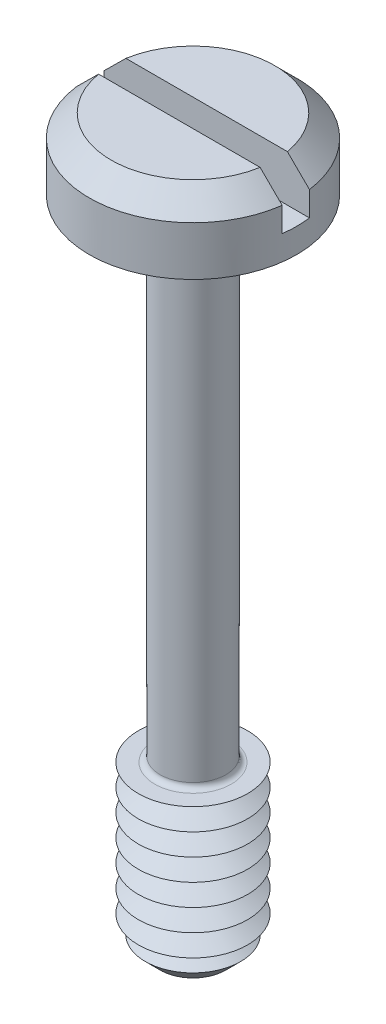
ISO-10303-21;
HEADER;
FILE_DESCRIPTION(('STEP AP214'),'2;1');
FILE_NAME('part.step','',(''),(''),'','','');
FILE_SCHEMA(('AUTOMOTIVE_DESIGN { 1 0 10303 214 1 1 1 1 }'));
ENDSEC;
DATA;
#1=APPLICATION_CONTEXT('core data for automotive mechanical design processes');
#2=APPLICATION_PROTOCOL_DEFINITION('international standard','automotive_design',2000,#1);
#3=PRODUCT_CONTEXT('',#1,'mechanical');
#4=PRODUCT('Part','Part','',(#3));
#5=PRODUCT_RELATED_PRODUCT_CATEGORY('part','',(#4));
#6=PRODUCT_DEFINITION_FORMATION('','',#4);
#7=PRODUCT_DEFINITION_CONTEXT('part definition',#1,'design');
#8=PRODUCT_DEFINITION('design','',#6,#7);
#9=PRODUCT_DEFINITION_SHAPE('','',#8);
#10=(LENGTH_UNIT() NAMED_UNIT(*) SI_UNIT(.MILLI.,.METRE.));
#11=(NAMED_UNIT(*) PLANE_ANGLE_UNIT() SI_UNIT($,.RADIAN.));
#12=(NAMED_UNIT(*) SI_UNIT($,.STERADIAN.) SOLID_ANGLE_UNIT());
#13=UNCERTAINTY_MEASURE_WITH_UNIT(LENGTH_MEASURE(1.E-05),#10,'distance_accuracy_value','');
#14=(GEOMETRIC_REPRESENTATION_CONTEXT(3) GLOBAL_UNCERTAINTY_ASSIGNED_CONTEXT((#13)) GLOBAL_UNIT_ASSIGNED_CONTEXT((#10,
#11,#12)) REPRESENTATION_CONTEXT('',''));
#15=CARTESIAN_POINT('',(0.,0.,0.));
#16=DIRECTION('',(0.,0.,1.));
#17=DIRECTION('',(1.,0.,0.));
#18=AXIS2_PLACEMENT_3D('',#15,#16,#17);
#19=CARTESIAN_POINT('',(0.,1.3,0.));
#20=DIRECTION('',(0.,1.,0.));
#21=DIRECTION('',(0.,0.,1.));
#22=AXIS2_PLACEMENT_3D('',#19,#20,#21);
#23=PLANE('',#22);
#24=DIRECTION('',(-1.,0.,0.));
#25=VECTOR('',#24,1.);
#26=CARTESIAN_POINT('',(1.9,1.3,-0.25));
#27=LINE('',#26,#25);
#28=CARTESIAN_POINT('',(1.4790199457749,1.3,-0.25));
#29=VERTEX_POINT('',#28);
#30=CARTESIAN_POINT('',(-1.4790199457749,1.3,-0.25));
#31=VERTEX_POINT('',#30);
#32=EDGE_CURVE('E110',#29,#31,#27,.T.);
#33=ORIENTED_EDGE('',*,*,#32,.F.);
#34=CARTESIAN_POINT('',(0.,1.3,0.));
#35=DIRECTION('',(0.,1.,0.));
#36=DIRECTION('',(0.,0.,1.));
#37=AXIS2_PLACEMENT_3D('',#34,#35,#36);
#38=CIRCLE('',#37,1.5);
#39=EDGE_CURVE('E113',#29,#31,#38,.T.);
#40=ORIENTED_EDGE('',*,*,#39,.T.);
#41=EDGE_LOOP('',(#33,#40));
#42=FACE_BOUND('',#41,.T.);
#43=ADVANCED_FACE('F39',(#42),#23,.T.);
#44=CARTESIAN_POINT('',(0.,1.3,0.));
#45=DIRECTION('',(0.,-1.,0.));
#46=DIRECTION('',(0.,0.,-1.));
#47=AXIS2_PLACEMENT_3D('',#44,#45,#46);
#48=CONICAL_SURFACE('',#47,1.5,0.785398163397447);
#49=CARTESIAN_POINT('',(4.18533688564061,-1.39279678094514,-0.25));
#50=CARTESIAN_POINT('',(4.04229038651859,-1.25000682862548,-0.25));
#51=CARTESIAN_POINT('',(3.89923277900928,-1.10722799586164,-0.25));
#52=CARTESIAN_POINT('',(3.61307916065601,-0.821704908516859,-0.25));
#53=CARTESIAN_POINT('',(3.46998314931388,-0.67896065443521,-0.25));
#54=CARTESIAN_POINT('',(3.1836962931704,-0.39347893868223,-0.25));
#55=CARTESIAN_POINT('',(3.0405054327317,-0.250741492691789,-0.25));
#56=CARTESIAN_POINT('',(2.75404923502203,0.0346548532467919,-0.25));
#57=CARTESIAN_POINT('',(2.61078389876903,0.177313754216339,-0.25));
#58=CARTESIAN_POINT('',(2.32055190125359,0.466067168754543,-0.25));
#59=CARTESIAN_POINT('',(2.17358212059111,0.612158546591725,-0.25));
#60=CARTESIAN_POINT('',(1.87941274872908,0.904121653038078,-0.25));
#61=CARTESIAN_POINT('',(1.73221314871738,1.04999337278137,-0.25));
#62=CARTESIAN_POINT('',(1.51107316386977,1.26842721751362,-0.25));
#63=CARTESIAN_POINT('',(1.43731034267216,1.34116907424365,-0.25));
#64=CARTESIAN_POINT('',(1.28959621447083,1.48646381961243,-0.25));
#65=CARTESIAN_POINT('',(1.21564490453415,1.55901670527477,-0.25));
#66=CARTESIAN_POINT('',(1.06743357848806,1.7037953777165,-0.25));
#67=CARTESIAN_POINT('',(0.993173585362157,1.77602118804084,-0.25));
#68=CARTESIAN_POINT('',(0.844093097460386,1.91989140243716,-0.25));
#69=CARTESIAN_POINT('',(0.769272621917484,1.99153582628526,-0.25));
#70=CARTESIAN_POINT('',(0.673453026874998,2.0816726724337,-0.25));
#71=CARTESIAN_POINT('',(0.653038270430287,2.10078477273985,-0.25));
#72=CARTESIAN_POINT('',(0.612082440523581,2.13887320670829,-0.25));
#73=CARTESIAN_POINT('',(0.591541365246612,2.15784953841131,-0.25));
#74=CARTESIAN_POINT('',(0.529771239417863,2.21444296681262,-0.25));
#75=CARTESIAN_POINT('',(0.488307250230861,2.25180787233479,-0.25));
#76=CARTESIAN_POINT('',(0.419663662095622,2.31168392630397,-0.25));
#77=CARTESIAN_POINT('',(0.392840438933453,2.33460285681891,-0.25));
#78=CARTESIAN_POINT('',(0.33832923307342,2.37961554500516,-0.25));
#79=CARTESIAN_POINT('',(0.310638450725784,2.40170598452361,-0.25));
#80=CARTESIAN_POINT('',(0.26798327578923,2.43362951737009,-0.25));
#81=CARTESIAN_POINT('',(0.253509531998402,2.44411383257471,-0.25));
#82=CARTESIAN_POINT('',(0.224109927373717,2.46442369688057,-0.25));
#83=CARTESIAN_POINT('',(0.209184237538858,2.47424949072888,-0.25));
#84=CARTESIAN_POINT('',(0.178776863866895,2.49288890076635,-0.25));
#85=CARTESIAN_POINT('',(0.163297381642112,2.50170604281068,-0.25));
#86=CARTESIAN_POINT('',(0.131578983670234,2.51781823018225,-0.25));
#87=CARTESIAN_POINT('',(0.11534152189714,2.52511605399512,-0.25));
#88=CARTESIAN_POINT('',(0.0816993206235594,2.53745946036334,-0.25));
#89=CARTESIAN_POINT('',(0.0642805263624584,2.54246888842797,-0.25));
#90=CARTESIAN_POINT('',(0.028863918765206,2.54892929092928,-0.25));
#91=CARTESIAN_POINT('',(0.0108708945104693,2.55040442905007,-0.25));
#92=CARTESIAN_POINT('',(-0.0250443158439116,2.54939473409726,-0.25));
#93=CARTESIAN_POINT('',(-0.0429661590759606,2.54689872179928,-0.25));
#94=CARTESIAN_POINT('',(-0.0781147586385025,2.53864961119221,-0.25));
#95=CARTESIAN_POINT('',(-0.0953356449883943,2.53287340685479,-0.25));
#96=CARTESIAN_POINT('',(-0.132199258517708,2.51779776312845,-0.25));
#97=CARTESIAN_POINT('',(-0.151639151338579,2.50802516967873,-0.25));
#98=CARTESIAN_POINT('',(-0.189519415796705,2.48667393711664,-0.25));
#99=CARTESIAN_POINT('',(-0.20795716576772,2.47509084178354,-0.25));
#100=CARTESIAN_POINT('',(-0.244227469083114,2.45076455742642,-0.25));
#101=CARTESIAN_POINT('',(-0.262054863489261,2.4380137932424,-0.25));
#102=CARTESIAN_POINT('',(-0.297164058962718,2.41183569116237,-0.25));
#103=CARTESIAN_POINT('',(-0.314446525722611,2.39840923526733,-0.25));
#104=CARTESIAN_POINT('',(-0.37105344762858,2.35323015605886,-0.25));
#105=CARTESIAN_POINT('',(-0.409598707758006,2.32050831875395,-0.25));
#106=CARTESIAN_POINT('',(-0.485753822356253,2.25398879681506,-0.25));
#107=CARTESIAN_POINT('',(-0.5233632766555,2.22019066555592,-0.25));
#108=CARTESIAN_POINT('',(-0.598084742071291,2.15194710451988,-0.25));
#109=CARTESIAN_POINT('',(-0.635196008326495,2.1175008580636,-0.25));
#110=CARTESIAN_POINT('',(-0.709072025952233,2.04825489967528,-0.25));
#111=CARTESIAN_POINT('',(-0.745836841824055,2.0134552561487,-0.25));
#112=CARTESIAN_POINT('',(-0.855349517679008,1.90914588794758,-0.25));
#113=CARTESIAN_POINT('',(-0.927775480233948,1.83929849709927,-0.25));
#114=CARTESIAN_POINT('',(-1.07215273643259,1.69921833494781,-0.25));
#115=CARTESIAN_POINT('',(-1.14410432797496,1.62898586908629,-0.25));
#116=CARTESIAN_POINT('',(-1.33992197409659,1.43719038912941,-0.25));
#117=CARTESIAN_POINT('',(-1.46354933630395,1.3153837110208,-0.25));
#118=CARTESIAN_POINT('',(-1.71048263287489,1.07144356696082,-0.25));
#119=CARTESIAN_POINT('',(-1.83378856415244,0.949310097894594,-0.25));
#120=CARTESIAN_POINT('',(-2.20352581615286,0.582566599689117,-0.25));
#121=CARTESIAN_POINT('',(-2.44969583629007,0.337693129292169,-0.25));
#122=CARTESIAN_POINT('',(-2.94423335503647,-0.154747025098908,-0.25));
#123=CARTESIAN_POINT('',(-3.19259832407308,-0.402316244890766,-0.25));
#124=CARTESIAN_POINT('',(-3.68909403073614,-0.897516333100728,-0.25));
#125=CARTESIAN_POINT('',(-3.93722481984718,-1.14514714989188,-0.25));
#126=CARTESIAN_POINT('',(-4.18533688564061,-1.39279678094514,-0.25));
#127=B_SPLINE_CURVE_WITH_KNOTS('',3,(#49,#50,#51,#52,#53,#54,#55,#56,#57,#58,#59,#60,#61,#62,
#63,#64,#65,#66,#67,#68,#69,#70,#71,#72,#73,#74,#75,#76,#77,#78,#79,#80,#81,#82,#83,#84,#85,#86,
#87,#88,#89,#90,#91,#92,#93,#94,#95,#96,#97,#98,#99,#100,#101,#102,#103,#104,#105,#106,#107,
#108,#109,#110,#111,#112,#113,#114,#115,#116,#117,#118,#119,#120,#121,#122,#123,#124,#125,#126),
.UNSPECIFIED.,.F.,.F.,(4,2,2,2,2,2,2,2,2,2,2,2,2,2,2,2,2,2,2,2,2,2,2,2,2,2,2,2,2,2,2,2,2,2,2,2,
2,2,4),(0.,0.606350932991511,1.2127101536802,1.81925643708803,2.42579463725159,3.04747398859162,
3.66917779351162,3.97996857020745,4.29076421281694,4.60153711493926,4.91229940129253,
4.99619332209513,5.08008845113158,5.24751495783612,5.35335108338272,5.45957361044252,
5.51317784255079,5.56676204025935,5.62015280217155,5.67344504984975,5.72755238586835,
5.78128872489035,5.83517660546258,5.88944887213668,5.95455572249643,6.01982542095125,
6.08555345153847,6.15119780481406,6.30282427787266,6.45451451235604,6.60641073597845,
6.75827809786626,7.06012987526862,7.36176945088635,7.88242595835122,8.40308744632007,
9.44475070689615,10.4967873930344,11.5484571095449),.UNSPECIFIED.);
#128=CARTESIAN_POINT('',(1.88348082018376,0.899999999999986,-0.25));
#129=VERTEX_POINT('',#128);
#130=EDGE_CURVE('E252',#129,#29,#127,.T.);
#131=ORIENTED_EDGE('',*,*,#130,.F.);
#132=CARTESIAN_POINT('',(0.,0.9,0.));
#133=DIRECTION('',(0.,1.,0.));
#134=DIRECTION('',(0.,0.,1.));
#135=AXIS2_PLACEMENT_3D('',#132,#133,#134);
#136=CIRCLE('',#135,1.9);
#137=CARTESIAN_POINT('',(-1.88348082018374,0.9,-0.25));
#138=VERTEX_POINT('',#137);
#139=EDGE_CURVE('E128',#138,#129,#136,.F.);
#140=ORIENTED_EDGE('',*,*,#139,.F.);
#141=EDGE_CURVE('E102',#31,#138,#127,.T.);
#142=ORIENTED_EDGE('',*,*,#141,.F.);
#143=ORIENTED_EDGE('',*,*,#39,.F.);
#144=EDGE_LOOP('',(#131,#140,#142,#143));
#145=FACE_BOUND('',#144,.T.);
#146=ADVANCED_FACE('F214',(#145),#48,.T.);
#147=CARTESIAN_POINT('',(0.,-12.,0.));
#148=DIRECTION('',(0.,1.,0.));
#149=DIRECTION('',(0.,0.,1.));
#150=AXIS2_PLACEMENT_3D('',#147,#148,#149);
#151=CYLINDRICAL_SURFACE('',#150,0.6);
#152=CARTESIAN_POINT('',(0.,-8.9,0.));
#153=DIRECTION('',(0.,-1.,0.));
#154=DIRECTION('',(0.,0.,-1.));
#155=AXIS2_PLACEMENT_3D('',#152,#153,#154);
#156=CIRCLE('',#155,0.6);
#157=CARTESIAN_POINT('',(0.,-8.9,-0.6));
#158=VERTEX_POINT('',#157);
#159=EDGE_CURVE('E123',#158,#158,#156,.F.);
#160=ORIENTED_EDGE('',*,*,#159,.T.);
#161=EDGE_LOOP('',(#160));
#162=FACE_BOUND('',#161,.T.);
#163=CARTESIAN_POINT('',(0.,-0.0999999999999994,0.));
#164=DIRECTION('',(0.,1.,0.));
#165=DIRECTION('',(0.,0.,1.));
#166=AXIS2_PLACEMENT_3D('',#163,#164,#165);
#167=CIRCLE('',#166,0.6);
#168=CARTESIAN_POINT('',(0.,-0.0999999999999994,0.6));
#169=VERTEX_POINT('',#168);
#170=EDGE_CURVE('E349',#169,#169,#167,.F.);
#171=ORIENTED_EDGE('',*,*,#170,.T.);
#172=EDGE_LOOP('',(#171));
#173=FACE_BOUND('',#172,.T.);
#174=ADVANCED_FACE('F210',(#162,#173),#151,.T.);
#175=CARTESIAN_POINT('',(0.,1.3,0.));
#176=DIRECTION('',(0.,-1.,0.));
#177=DIRECTION('',(0.,0.,-1.));
#178=AXIS2_PLACEMENT_3D('',#175,#176,#177);
#179=CYLINDRICAL_SURFACE('',#178,1.9);
#180=ORIENTED_EDGE('',*,*,#139,.T.);
#181=DIRECTION('',(0.,-1.,0.));
#182=VECTOR('',#181,1.);
#183=CARTESIAN_POINT('',(1.88348082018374,1.3,-0.25));
#184=LINE('',#183,#182);
#185=CARTESIAN_POINT('',(1.88348082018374,0.45,-0.25));
#186=VERTEX_POINT('',#185);
#187=EDGE_CURVE('E64',#129,#186,#184,.T.);
#188=ORIENTED_EDGE('',*,*,#187,.T.);
#189=CARTESIAN_POINT('',(0.,0.45,0.));
#190=DIRECTION('',(0.,1.,0.));
#191=DIRECTION('',(0.,0.,1.));
#192=AXIS2_PLACEMENT_3D('',#189,#190,#191);
#193=CIRCLE('',#192,1.9);
#194=CARTESIAN_POINT('',(1.88348082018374,0.45,0.25));
#195=VERTEX_POINT('',#194);
#196=EDGE_CURVE('E11',#195,#186,#193,.T.);
#197=ORIENTED_EDGE('',*,*,#196,.F.);
#198=DIRECTION('',(0.,-1.,0.));
#199=VECTOR('',#198,1.);
#200=CARTESIAN_POINT('',(1.88348082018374,1.3,0.25));
#201=LINE('',#200,#199);
#202=CARTESIAN_POINT('',(1.88348082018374,0.9,0.25));
#203=VERTEX_POINT('',#202);
#204=EDGE_CURVE('E268',#195,#203,#201,.F.);
#205=ORIENTED_EDGE('',*,*,#204,.T.);
#206=CARTESIAN_POINT('',(-1.88348082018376,0.899999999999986,0.25));
#207=VERTEX_POINT('',#206);
#208=EDGE_CURVE('E120',#203,#207,#136,.F.);
#209=ORIENTED_EDGE('',*,*,#208,.T.);
#210=DIRECTION('',(0.,-1.,0.));
#211=VECTOR('',#210,1.);
#212=CARTESIAN_POINT('',(-1.88348082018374,1.3,0.25));
#213=LINE('',#212,#211);
#214=CARTESIAN_POINT('',(-1.88348082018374,0.45,0.25));
#215=VERTEX_POINT('',#214);
#216=EDGE_CURVE('E96',#207,#215,#213,.T.);
#217=ORIENTED_EDGE('',*,*,#216,.T.);
#218=CARTESIAN_POINT('',(-1.88348082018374,0.45,-0.25));
#219=VERTEX_POINT('',#218);
#220=EDGE_CURVE('E44',#219,#215,#193,.T.);
#221=ORIENTED_EDGE('',*,*,#220,.F.);
#222=DIRECTION('',(0.,-1.,0.));
#223=VECTOR('',#222,1.);
#224=CARTESIAN_POINT('',(-1.88348082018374,1.3,-0.25));
#225=LINE('',#224,#223);
#226=EDGE_CURVE('E272',#219,#138,#225,.F.);
#227=ORIENTED_EDGE('',*,*,#226,.T.);
#228=EDGE_LOOP('',(#180,#188,#197,#205,#209,#217,#221,#227));
#229=FACE_BOUND('',#228,.T.);
#230=CARTESIAN_POINT('',(0.,0.,0.));
#231=DIRECTION('',(0.,1.,0.));
#232=DIRECTION('',(0.,0.,1.));
#233=AXIS2_PLACEMENT_3D('',#230,#231,#232);
#234=CIRCLE('',#233,1.9);
#235=CARTESIAN_POINT('',(0.,0.,1.9));
#236=VERTEX_POINT('',#235);
#237=EDGE_CURVE('E334',#236,#236,#234,.T.);
#238=ORIENTED_EDGE('',*,*,#237,.T.);
#239=EDGE_LOOP('',(#238));
#240=FACE_BOUND('',#239,.T.);
#241=ADVANCED_FACE('F213',(#229,#240),#179,.T.);
#242=DIRECTION('',(1.,0.,0.));
#243=VECTOR('',#242,1.);
#244=CARTESIAN_POINT('',(1.9,1.3,0.25));
#245=LINE('',#244,#243);
#246=CARTESIAN_POINT('',(-1.4790199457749,1.3,0.25));
#247=VERTEX_POINT('',#246);
#248=CARTESIAN_POINT('',(1.47901994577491,1.3,0.25));
#249=VERTEX_POINT('',#248);
#250=EDGE_CURVE('E56',#247,#249,#245,.T.);
#251=ORIENTED_EDGE('',*,*,#250,.F.);
#252=EDGE_CURVE('E108',#247,#249,#38,.T.);
#253=ORIENTED_EDGE('',*,*,#252,.T.);
#254=EDGE_LOOP('',(#251,#253));
#255=FACE_BOUND('',#254,.T.);
#256=ADVANCED_FACE('F107',(#255),#23,.T.);
#257=CARTESIAN_POINT('',(0.,0.,0.));
#258=DIRECTION('',(0.,1.,0.));
#259=DIRECTION('',(0.,0.,1.));
#260=AXIS2_PLACEMENT_3D('',#257,#258,#259);
#261=PLANE('',#260);
#262=CARTESIAN_POINT('',(0.,0.,0.));
#263=DIRECTION('',(0.,1.,0.));
#264=DIRECTION('',(0.,0.,1.));
#265=AXIS2_PLACEMENT_3D('',#262,#263,#264);
#266=CIRCLE('',#265,0.7);
#267=CARTESIAN_POINT('',(0.,0.,0.7));
#268=VERTEX_POINT('',#267);
#269=EDGE_CURVE('E114',#268,#268,#266,.T.);
#270=ORIENTED_EDGE('',*,*,#269,.T.);
#271=EDGE_LOOP('',(#270));
#272=FACE_BOUND('',#271,.T.);
#273=ORIENTED_EDGE('',*,*,#237,.F.);
#274=EDGE_LOOP('',(#273));
#275=FACE_BOUND('',#274,.T.);
#276=ADVANCED_FACE('F204',(#272,#275),#261,.F.);
#277=CARTESIAN_POINT('',(0.,-9.,0.));
#278=DIRECTION('',(0.,-1.,0.));
#279=DIRECTION('',(0.,0.,-1.));
#280=AXIS2_PLACEMENT_3D('',#277,#278,#279);
#281=PLANE('',#280);
#282=CARTESIAN_POINT('',(0.,-9.,0.));
#283=DIRECTION('',(0.,-1.,0.));
#284=DIRECTION('',(0.,0.,-1.));
#285=AXIS2_PLACEMENT_3D('',#282,#283,#284);
#286=CIRCLE('',#285,0.7);
#287=CARTESIAN_POINT('',(0.,-9.,-0.7));
#288=VERTEX_POINT('',#287);
#289=EDGE_CURVE('E342',#288,#288,#286,.T.);
#290=ORIENTED_EDGE('',*,*,#289,.T.);
#291=EDGE_LOOP('',(#290));
#292=FACE_BOUND('',#291,.T.);
#293=CARTESIAN_POINT('',(0.,-9.,0.));
#294=DIRECTION('',(0.,1.,0.));
#295=DIRECTION('',(0.,0.,1.));
#296=AXIS2_PLACEMENT_3D('',#293,#294,#295);
#297=CIRCLE('',#296,1.);
#298=CARTESIAN_POINT('',(0.,-9.,1.));
#299=VERTEX_POINT('',#298);
#300=EDGE_CURVE('E331',#299,#299,#297,.T.);
#301=ORIENTED_EDGE('',*,*,#300,.T.);
#302=EDGE_LOOP('',(#301));
#303=FACE_BOUND('',#302,.T.);
#304=ADVANCED_FACE('F200',(#292,#303),#281,.F.);
#305=CARTESIAN_POINT('',(0.,-9.2,0.));
#306=DIRECTION('',(0.,1.,0.));
#307=DIRECTION('',(0.,0.,1.));
#308=AXIS2_PLACEMENT_3D('',#305,#306,#307);
#309=CONICAL_SURFACE('',#308,0.653589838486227,1.0471975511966);
#310=ORIENTED_EDGE('',*,*,#300,.F.);
#311=EDGE_LOOP('',(#310));
#312=FACE_BOUND('',#311,.T.);
#313=CARTESIAN_POINT('',(0.,-9.2,0.));
#314=DIRECTION('',(0.,1.,0.));
#315=DIRECTION('',(0.,0.,1.));
#316=AXIS2_PLACEMENT_3D('',#313,#314,#315);
#317=CIRCLE('',#316,0.653589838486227);
#318=CARTESIAN_POINT('',(0.,-9.2,0.653589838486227));
#319=VERTEX_POINT('',#318);
#320=EDGE_CURVE('E328',#319,#319,#317,.T.);
#321=ORIENTED_EDGE('',*,*,#320,.T.);
#322=EDGE_LOOP('',(#321));
#323=FACE_BOUND('',#322,.T.);
#324=ADVANCED_FACE('F196',(#312,#323),#309,.T.);
#325=CARTESIAN_POINT('',(0.,-9.4,0.));
#326=DIRECTION('',(0.,-1.,0.));
#327=DIRECTION('',(0.,0.,-1.));
#328=AXIS2_PLACEMENT_3D('',#325,#326,#327);
#329=CONICAL_SURFACE('',#328,1.,1.0471975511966);
#330=ORIENTED_EDGE('',*,*,#320,.F.);
#331=EDGE_LOOP('',(#330));
#332=FACE_BOUND('',#331,.T.);
#333=CARTESIAN_POINT('',(0.,-9.4,0.));
#334=DIRECTION('',(0.,1.,0.));
#335=DIRECTION('',(0.,0.,1.));
#336=AXIS2_PLACEMENT_3D('',#333,#334,#335);
#337=CIRCLE('',#336,1.);
#338=CARTESIAN_POINT('',(0.,-9.4,1.));
#339=VERTEX_POINT('',#338);
#340=EDGE_CURVE('E325',#339,#339,#337,.T.);
#341=ORIENTED_EDGE('',*,*,#340,.T.);
#342=EDGE_LOOP('',(#341));
#343=FACE_BOUND('',#342,.T.);
#344=ADVANCED_FACE('F192',(#332,#343),#329,.T.);
#345=CARTESIAN_POINT('',(0.,-9.6,0.));
#346=DIRECTION('',(0.,1.,0.));
#347=DIRECTION('',(0.,0.,1.));
#348=AXIS2_PLACEMENT_3D('',#345,#346,#347);
#349=CONICAL_SURFACE('',#348,0.653589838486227,1.0471975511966);
#350=ORIENTED_EDGE('',*,*,#340,.F.);
#351=EDGE_LOOP('',(#350));
#352=FACE_BOUND('',#351,.T.);
#353=CARTESIAN_POINT('',(0.,-9.6,0.));
#354=DIRECTION('',(0.,1.,0.));
#355=DIRECTION('',(0.,0.,1.));
#356=AXIS2_PLACEMENT_3D('',#353,#354,#355);
#357=CIRCLE('',#356,0.653589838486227);
#358=CARTESIAN_POINT('',(0.,-9.6,0.653589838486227));
#359=VERTEX_POINT('',#358);
#360=EDGE_CURVE('E321',#359,#359,#357,.T.);
#361=ORIENTED_EDGE('',*,*,#360,.T.);
#362=EDGE_LOOP('',(#361));
#363=FACE_BOUND('',#362,.T.);
#364=ADVANCED_FACE('F188',(#352,#363),#349,.T.);
#365=CARTESIAN_POINT('',(0.,-9.8,0.));
#366=DIRECTION('',(0.,-1.,0.));
#367=DIRECTION('',(0.,0.,-1.));
#368=AXIS2_PLACEMENT_3D('',#365,#366,#367);
#369=CONICAL_SURFACE('',#368,1.,1.0471975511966);
#370=ORIENTED_EDGE('',*,*,#360,.F.);
#371=EDGE_LOOP('',(#370));
#372=FACE_BOUND('',#371,.T.);
#373=CARTESIAN_POINT('',(0.,-9.8,0.));
#374=DIRECTION('',(0.,1.,0.));
#375=DIRECTION('',(0.,0.,1.));
#376=AXIS2_PLACEMENT_3D('',#373,#374,#375);
#377=CIRCLE('',#376,1.);
#378=CARTESIAN_POINT('',(0.,-9.8,1.));
#379=VERTEX_POINT('',#378);
#380=EDGE_CURVE('E317',#379,#379,#377,.T.);
#381=ORIENTED_EDGE('',*,*,#380,.T.);
#382=EDGE_LOOP('',(#381));
#383=FACE_BOUND('',#382,.T.);
#384=ADVANCED_FACE('F184',(#372,#383),#369,.T.);
#385=CARTESIAN_POINT('',(0.,-10.,0.));
#386=DIRECTION('',(0.,1.,0.));
#387=DIRECTION('',(0.,0.,1.));
#388=AXIS2_PLACEMENT_3D('',#385,#386,#387);
#389=CONICAL_SURFACE('',#388,0.653589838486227,1.0471975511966);
#390=ORIENTED_EDGE('',*,*,#380,.F.);
#391=EDGE_LOOP('',(#390));
#392=FACE_BOUND('',#391,.T.);
#393=CARTESIAN_POINT('',(0.,-10.,0.));
#394=DIRECTION('',(0.,1.,0.));
#395=DIRECTION('',(0.,0.,1.));
#396=AXIS2_PLACEMENT_3D('',#393,#394,#395);
#397=CIRCLE('',#396,0.653589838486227);
#398=CARTESIAN_POINT('',(0.,-10.,0.653589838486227));
#399=VERTEX_POINT('',#398);
#400=EDGE_CURVE('E313',#399,#399,#397,.T.);
#401=ORIENTED_EDGE('',*,*,#400,.T.);
#402=EDGE_LOOP('',(#401));
#403=FACE_BOUND('',#402,.T.);
#404=ADVANCED_FACE('F180',(#392,#403),#389,.T.);
#405=CARTESIAN_POINT('',(0.,-10.2,0.));
#406=DIRECTION('',(0.,-1.,0.));
#407=DIRECTION('',(0.,0.,-1.));
#408=AXIS2_PLACEMENT_3D('',#405,#406,#407);
#409=CONICAL_SURFACE('',#408,1.,1.0471975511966);
#410=ORIENTED_EDGE('',*,*,#400,.F.);
#411=EDGE_LOOP('',(#410));
#412=FACE_BOUND('',#411,.T.);
#413=CARTESIAN_POINT('',(0.,-10.2,0.));
#414=DIRECTION('',(0.,1.,0.));
#415=DIRECTION('',(0.,0.,1.));
#416=AXIS2_PLACEMENT_3D('',#413,#414,#415);
#417=CIRCLE('',#416,1.);
#418=CARTESIAN_POINT('',(0.,-10.2,1.));
#419=VERTEX_POINT('',#418);
#420=EDGE_CURVE('E309',#419,#419,#417,.T.);
#421=ORIENTED_EDGE('',*,*,#420,.T.);
#422=EDGE_LOOP('',(#421));
#423=FACE_BOUND('',#422,.T.);
#424=ADVANCED_FACE('F176',(#412,#423),#409,.T.);
#425=CARTESIAN_POINT('',(0.,-10.4,0.));
#426=DIRECTION('',(0.,1.,0.));
#427=DIRECTION('',(0.,0.,1.));
#428=AXIS2_PLACEMENT_3D('',#425,#426,#427);
#429=CONICAL_SURFACE('',#428,0.653589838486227,1.0471975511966);
#430=ORIENTED_EDGE('',*,*,#420,.F.);
#431=EDGE_LOOP('',(#430));
#432=FACE_BOUND('',#431,.T.);
#433=CARTESIAN_POINT('',(0.,-10.4,0.));
#434=DIRECTION('',(0.,1.,0.));
#435=DIRECTION('',(0.,0.,1.));
#436=AXIS2_PLACEMENT_3D('',#433,#434,#435);
#437=CIRCLE('',#436,0.653589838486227);
#438=CARTESIAN_POINT('',(0.,-10.4,0.653589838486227));
#439=VERTEX_POINT('',#438);
#440=EDGE_CURVE('E305',#439,#439,#437,.T.);
#441=ORIENTED_EDGE('',*,*,#440,.T.);
#442=EDGE_LOOP('',(#441));
#443=FACE_BOUND('',#442,.T.);
#444=ADVANCED_FACE('F172',(#432,#443),#429,.T.);
#445=CARTESIAN_POINT('',(0.,-10.6,0.));
#446=DIRECTION('',(0.,-1.,0.));
#447=DIRECTION('',(0.,0.,-1.));
#448=AXIS2_PLACEMENT_3D('',#445,#446,#447);
#449=CONICAL_SURFACE('',#448,1.,1.0471975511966);
#450=ORIENTED_EDGE('',*,*,#440,.F.);
#451=EDGE_LOOP('',(#450));
#452=FACE_BOUND('',#451,.T.);
#453=CARTESIAN_POINT('',(0.,-10.6,0.));
#454=DIRECTION('',(0.,1.,0.));
#455=DIRECTION('',(0.,0.,1.));
#456=AXIS2_PLACEMENT_3D('',#453,#454,#455);
#457=CIRCLE('',#456,1.);
#458=CARTESIAN_POINT('',(0.,-10.6,1.));
#459=VERTEX_POINT('',#458);
#460=EDGE_CURVE('E301',#459,#459,#457,.T.);
#461=ORIENTED_EDGE('',*,*,#460,.T.);
#462=EDGE_LOOP('',(#461));
#463=FACE_BOUND('',#462,.T.);
#464=ADVANCED_FACE('F168',(#452,#463),#449,.T.);
#465=CARTESIAN_POINT('',(0.,-10.8,0.));
#466=DIRECTION('',(0.,1.,0.));
#467=DIRECTION('',(0.,0.,1.));
#468=AXIS2_PLACEMENT_3D('',#465,#466,#467);
#469=CONICAL_SURFACE('',#468,0.653589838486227,1.0471975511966);
#470=ORIENTED_EDGE('',*,*,#460,.F.);
#471=EDGE_LOOP('',(#470));
#472=FACE_BOUND('',#471,.T.);
#473=CARTESIAN_POINT('',(0.,-10.8,0.));
#474=DIRECTION('',(0.,1.,0.));
#475=DIRECTION('',(0.,0.,1.));
#476=AXIS2_PLACEMENT_3D('',#473,#474,#475);
#477=CIRCLE('',#476,0.653589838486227);
#478=CARTESIAN_POINT('',(0.,-10.8,0.653589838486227));
#479=VERTEX_POINT('',#478);
#480=EDGE_CURVE('E297',#479,#479,#477,.T.);
#481=ORIENTED_EDGE('',*,*,#480,.T.);
#482=EDGE_LOOP('',(#481));
#483=FACE_BOUND('',#482,.T.);
#484=ADVANCED_FACE('F164',(#472,#483),#469,.T.);
#485=CARTESIAN_POINT('',(0.,-11.,0.));
#486=DIRECTION('',(0.,-1.,0.));
#487=DIRECTION('',(0.,0.,-1.));
#488=AXIS2_PLACEMENT_3D('',#485,#486,#487);
#489=CONICAL_SURFACE('',#488,1.,1.0471975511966);
#490=ORIENTED_EDGE('',*,*,#480,.F.);
#491=EDGE_LOOP('',(#490));
#492=FACE_BOUND('',#491,.T.);
#493=CARTESIAN_POINT('',(0.,-11.,0.));
#494=DIRECTION('',(0.,1.,0.));
#495=DIRECTION('',(0.,0.,1.));
#496=AXIS2_PLACEMENT_3D('',#493,#494,#495);
#497=CIRCLE('',#496,1.);
#498=CARTESIAN_POINT('',(0.,-11.,1.));
#499=VERTEX_POINT('',#498);
#500=EDGE_CURVE('E293',#499,#499,#497,.T.);
#501=ORIENTED_EDGE('',*,*,#500,.T.);
#502=EDGE_LOOP('',(#501));
#503=FACE_BOUND('',#502,.T.);
#504=ADVANCED_FACE('F160',(#492,#503),#489,.T.);
#505=CARTESIAN_POINT('',(0.,-11.2,0.));
#506=DIRECTION('',(0.,1.,0.));
#507=DIRECTION('',(0.,0.,1.));
#508=AXIS2_PLACEMENT_3D('',#505,#506,#507);
#509=CONICAL_SURFACE('',#508,0.653589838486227,1.0471975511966);
#510=ORIENTED_EDGE('',*,*,#500,.F.);
#511=EDGE_LOOP('',(#510));
#512=FACE_BOUND('',#511,.T.);
#513=CARTESIAN_POINT('',(0.,-11.2,0.));
#514=DIRECTION('',(0.,1.,0.));
#515=DIRECTION('',(0.,0.,1.));
#516=AXIS2_PLACEMENT_3D('',#513,#514,#515);
#517=CIRCLE('',#516,0.653589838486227);
#518=CARTESIAN_POINT('',(0.,-11.2,0.653589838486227));
#519=VERTEX_POINT('',#518);
#520=EDGE_CURVE('E290',#519,#519,#517,.T.);
#521=ORIENTED_EDGE('',*,*,#520,.T.);
#522=EDGE_LOOP('',(#521));
#523=FACE_BOUND('',#522,.T.);
#524=ADVANCED_FACE('F156',(#512,#523),#509,.T.);
#525=CARTESIAN_POINT('',(0.,-11.4,0.));
#526=DIRECTION('',(0.,-1.,0.));
#527=DIRECTION('',(0.,0.,-1.));
#528=AXIS2_PLACEMENT_3D('',#525,#526,#527);
#529=CONICAL_SURFACE('',#528,1.,1.0471975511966);
#530=ORIENTED_EDGE('',*,*,#520,.F.);
#531=EDGE_LOOP('',(#530));
#532=FACE_BOUND('',#531,.T.);
#533=CARTESIAN_POINT('',(0.,-11.4,0.));
#534=DIRECTION('',(0.,1.,0.));
#535=DIRECTION('',(0.,0.,1.));
#536=AXIS2_PLACEMENT_3D('',#533,#534,#535);
#537=CIRCLE('',#536,1.);
#538=CARTESIAN_POINT('',(0.,-11.4,1.));
#539=VERTEX_POINT('',#538);
#540=EDGE_CURVE('E285',#539,#539,#537,.T.);
#541=ORIENTED_EDGE('',*,*,#540,.T.);
#542=EDGE_LOOP('',(#541));
#543=FACE_BOUND('',#542,.T.);
#544=ADVANCED_FACE('F152',(#532,#543),#529,.T.);
#545=CARTESIAN_POINT('',(0.,-11.6,0.));
#546=DIRECTION('',(0.,1.,0.));
#547=DIRECTION('',(0.,0.,1.));
#548=AXIS2_PLACEMENT_3D('',#545,#546,#547);
#549=CONICAL_SURFACE('',#548,0.653589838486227,1.0471975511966);
#550=ORIENTED_EDGE('',*,*,#540,.F.);
#551=EDGE_LOOP('',(#550));
#552=FACE_BOUND('',#551,.T.);
#553=CARTESIAN_POINT('',(0.,-11.6,0.));
#554=DIRECTION('',(0.,1.,0.));
#555=DIRECTION('',(0.,0.,1.));
#556=AXIS2_PLACEMENT_3D('',#553,#554,#555);
#557=CIRCLE('',#556,0.653589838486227);
#558=CARTESIAN_POINT('',(0.,-11.6,0.653589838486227));
#559=VERTEX_POINT('',#558);
#560=EDGE_CURVE('E281',#559,#559,#557,.T.);
#561=ORIENTED_EDGE('',*,*,#560,.T.);
#562=EDGE_LOOP('',(#561));
#563=FACE_BOUND('',#562,.T.);
#564=ADVANCED_FACE('F148',(#552,#563),#549,.T.);
#565=CARTESIAN_POINT('',(0.,-11.8,0.));
#566=DIRECTION('',(0.,-1.,0.));
#567=DIRECTION('',(0.,0.,-1.));
#568=AXIS2_PLACEMENT_3D('',#565,#566,#567);
#569=CONICAL_SURFACE('',#568,1.,1.0471975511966);
#570=CARTESIAN_POINT('',(0.,-11.7267949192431,0.));
#571=DIRECTION('',(0.,-1.,0.));
#572=DIRECTION('',(0.,0.,-1.));
#573=AXIS2_PLACEMENT_3D('',#570,#571,#572);
#574=CIRCLE('',#573,0.87320508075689);
#575=CARTESIAN_POINT('',(0.,-11.7267949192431,-0.87320508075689));
#576=VERTEX_POINT('',#575);
#577=EDGE_CURVE('E289',#576,#576,#574,.F.);
#578=ORIENTED_EDGE('',*,*,#577,.T.);
#579=EDGE_LOOP('',(#578));
#580=FACE_BOUND('',#579,.T.);
#581=ORIENTED_EDGE('',*,*,#560,.F.);
#582=EDGE_LOOP('',(#581));
#583=FACE_BOUND('',#582,.T.);
#584=ADVANCED_FACE('F144',(#580,#583),#569,.T.);
#585=CARTESIAN_POINT('',(0.,-12.,0.));
#586=DIRECTION('',(0.,-1.,0.));
#587=DIRECTION('',(0.,0.,-1.));
#588=AXIS2_PLACEMENT_3D('',#585,#586,#587);
#589=PLANE('',#588);
#590=CARTESIAN_POINT('',(0.,-12.,0.));
#591=DIRECTION('',(0.,-1.,0.));
#592=DIRECTION('',(0.,0.,-1.));
#593=AXIS2_PLACEMENT_3D('',#590,#591,#592);
#594=CIRCLE('',#593,0.6);
#595=CARTESIAN_POINT('',(0.,-12.,-0.6));
#596=VERTEX_POINT('',#595);
#597=EDGE_CURVE('E338',#596,#596,#594,.T.);
#598=ORIENTED_EDGE('',*,*,#597,.T.);
#599=EDGE_LOOP('',(#598));
#600=FACE_BOUND('',#599,.T.);
#601=ADVANCED_FACE('F147',(#600),#589,.T.);
#602=CARTESIAN_POINT('',(0.,-12.,0.));
#603=DIRECTION('',(0.,1.,0.));
#604=DIRECTION('',(0.,0.,1.));
#605=AXIS2_PLACEMENT_3D('',#602,#603,#604);
#606=CONICAL_SURFACE('',#605,0.6,0.785398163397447);
#607=ORIENTED_EDGE('',*,*,#577,.F.);
#608=EDGE_LOOP('',(#607));
#609=FACE_BOUND('',#608,.T.);
#610=ORIENTED_EDGE('',*,*,#597,.F.);
#611=EDGE_LOOP('',(#610));
#612=FACE_BOUND('',#611,.T.);
#613=ADVANCED_FACE('F208',(#609,#612),#606,.T.);
#614=CARTESIAN_POINT('',(0.,-8.9,0.));
#615=DIRECTION('',(0.,-1.,0.));
#616=DIRECTION('',(0.,0.,-1.));
#617=AXIS2_PLACEMENT_3D('',#614,#615,#616);
#618=TOROIDAL_SURFACE('',#617,0.7,0.1);
#619=ORIENTED_EDGE('',*,*,#159,.F.);
#620=EDGE_LOOP('',(#619));
#621=FACE_BOUND('',#620,.T.);
#622=ORIENTED_EDGE('',*,*,#289,.F.);
#623=EDGE_LOOP('',(#622));
#624=FACE_BOUND('',#623,.T.);
#625=ADVANCED_FACE('F226',(#621,#624),#618,.F.);
#626=CARTESIAN_POINT('',(0.,-0.0999999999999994,0.));
#627=DIRECTION('',(0.,1.,0.));
#628=DIRECTION('',(0.,0.,1.));
#629=AXIS2_PLACEMENT_3D('',#626,#627,#628);
#630=TOROIDAL_SURFACE('',#629,0.7,0.1);
#631=ORIENTED_EDGE('',*,*,#269,.F.);
#632=EDGE_LOOP('',(#631));
#633=FACE_BOUND('',#632,.T.);
#634=ORIENTED_EDGE('',*,*,#170,.F.);
#635=EDGE_LOOP('',(#634));
#636=FACE_BOUND('',#635,.T.);
#637=ADVANCED_FACE('F229',(#633,#636),#630,.F.);
#638=CARTESIAN_POINT('',(-4.18533688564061,-1.39279678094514,0.25));
#639=CARTESIAN_POINT('',(-4.04229038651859,-1.25000682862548,0.25));
#640=CARTESIAN_POINT('',(-3.89923277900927,-1.10722799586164,0.25));
#641=CARTESIAN_POINT('',(-3.61307916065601,-0.821704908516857,0.25));
#642=CARTESIAN_POINT('',(-3.46998314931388,-0.678960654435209,0.25));
#643=CARTESIAN_POINT('',(-3.1836962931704,-0.393478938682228,0.25));
#644=CARTESIAN_POINT('',(-3.0405054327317,-0.250741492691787,0.25));
#645=CARTESIAN_POINT('',(-2.75404923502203,0.0346548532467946,0.25));
#646=CARTESIAN_POINT('',(-2.61078389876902,0.177313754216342,0.25));
#647=CARTESIAN_POINT('',(-2.32055190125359,0.466067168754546,0.25));
#648=CARTESIAN_POINT('',(-2.17358212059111,0.612158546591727,0.25));
#649=CARTESIAN_POINT('',(-1.87941274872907,0.90412165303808,0.25));
#650=CARTESIAN_POINT('',(-1.73221314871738,1.04999337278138,0.25));
#651=CARTESIAN_POINT('',(-1.51107316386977,1.26842721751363,0.25));
#652=CARTESIAN_POINT('',(-1.43731034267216,1.34116907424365,0.25));
#653=CARTESIAN_POINT('',(-1.28959621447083,1.48646381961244,0.25));
#654=CARTESIAN_POINT('',(-1.21564490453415,1.55901670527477,0.25));
#655=CARTESIAN_POINT('',(-1.06743357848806,1.7037953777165,0.25));
#656=CARTESIAN_POINT('',(-0.993173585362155,1.77602118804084,0.25));
#657=CARTESIAN_POINT('',(-0.844093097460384,1.91989140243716,0.25));
#658=CARTESIAN_POINT('',(-0.769272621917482,1.99153582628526,0.25));
#659=CARTESIAN_POINT('',(-0.673453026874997,2.0816726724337,0.25));
#660=CARTESIAN_POINT('',(-0.653038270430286,2.10078477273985,0.25));
#661=CARTESIAN_POINT('',(-0.61208244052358,2.13887320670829,0.25));
#662=CARTESIAN_POINT('',(-0.591541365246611,2.15784953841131,0.25));
#663=CARTESIAN_POINT('',(-0.529771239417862,2.21444296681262,0.25));
#664=CARTESIAN_POINT('',(-0.488307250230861,2.25180787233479,0.25));
#665=CARTESIAN_POINT('',(-0.419663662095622,2.31168392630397,0.25));
#666=CARTESIAN_POINT('',(-0.392840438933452,2.33460285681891,0.25));
#667=CARTESIAN_POINT('',(-0.338329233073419,2.37961554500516,0.25));
#668=CARTESIAN_POINT('',(-0.310638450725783,2.40170598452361,0.25));
#669=CARTESIAN_POINT('',(-0.26798327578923,2.43362951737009,0.25));
#670=CARTESIAN_POINT('',(-0.253509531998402,2.44411383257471,0.25));
#671=CARTESIAN_POINT('',(-0.224109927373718,2.46442369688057,0.25));
#672=CARTESIAN_POINT('',(-0.209184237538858,2.47424949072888,0.25));
#673=CARTESIAN_POINT('',(-0.178776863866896,2.49288890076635,0.25));
#674=CARTESIAN_POINT('',(-0.163297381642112,2.50170604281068,0.25));
#675=CARTESIAN_POINT('',(-0.131578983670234,2.51781823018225,0.25));
#676=CARTESIAN_POINT('',(-0.115341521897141,2.52511605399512,0.25));
#677=CARTESIAN_POINT('',(-0.0816993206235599,2.53745946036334,0.25));
#678=CARTESIAN_POINT('',(-0.0642805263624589,2.54246888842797,0.25));
#679=CARTESIAN_POINT('',(-0.0288639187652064,2.54892929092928,0.25));
#680=CARTESIAN_POINT('',(-0.0108708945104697,2.55040442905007,0.25));
#681=CARTESIAN_POINT('',(0.0250443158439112,2.54939473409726,0.25));
#682=CARTESIAN_POINT('',(0.0429661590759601,2.54689872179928,0.25));
#683=CARTESIAN_POINT('',(0.0781147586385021,2.53864961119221,0.25));
#684=CARTESIAN_POINT('',(0.0953356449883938,2.53287340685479,0.25));
#685=CARTESIAN_POINT('',(0.132199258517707,2.51779776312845,0.25));
#686=CARTESIAN_POINT('',(0.151639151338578,2.50802516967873,0.25));
#687=CARTESIAN_POINT('',(0.189519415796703,2.48667393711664,0.25));
#688=CARTESIAN_POINT('',(0.207957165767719,2.47509084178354,0.25));
#689=CARTESIAN_POINT('',(0.244227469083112,2.45076455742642,0.25));
#690=CARTESIAN_POINT('',(0.26205486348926,2.4380137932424,0.25));
#691=CARTESIAN_POINT('',(0.297164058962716,2.41183569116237,0.25));
#692=CARTESIAN_POINT('',(0.314446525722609,2.39840923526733,0.25));
#693=CARTESIAN_POINT('',(0.371053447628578,2.35323015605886,0.25));
#694=CARTESIAN_POINT('',(0.409598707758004,2.32050831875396,0.25));
#695=CARTESIAN_POINT('',(0.48575382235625,2.25398879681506,0.25));
#696=CARTESIAN_POINT('',(0.523363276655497,2.22019066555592,0.25));
#697=CARTESIAN_POINT('',(0.598084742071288,2.15194710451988,0.25));
#698=CARTESIAN_POINT('',(0.635196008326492,2.1175008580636,0.25));
#699=CARTESIAN_POINT('',(0.709072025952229,2.04825489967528,0.25));
#700=CARTESIAN_POINT('',(0.74583684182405,2.01345525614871,0.25));
#701=CARTESIAN_POINT('',(0.855349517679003,1.90914588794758,0.25));
#702=CARTESIAN_POINT('',(0.927775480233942,1.83929849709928,0.25));
#703=CARTESIAN_POINT('',(1.07215273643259,1.69921833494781,0.25));
#704=CARTESIAN_POINT('',(1.14410432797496,1.6289858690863,0.25));
#705=CARTESIAN_POINT('',(1.33992197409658,1.43719038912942,0.25));
#706=CARTESIAN_POINT('',(1.46354933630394,1.31538371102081,0.25));
#707=CARTESIAN_POINT('',(1.71048263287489,1.07144356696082,0.25));
#708=CARTESIAN_POINT('',(1.83378856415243,0.949310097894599,0.25));
#709=CARTESIAN_POINT('',(2.20352581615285,0.582566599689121,0.25));
#710=CARTESIAN_POINT('',(2.44969583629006,0.337693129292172,0.25));
#711=CARTESIAN_POINT('',(2.94423335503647,-0.154747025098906,0.25));
#712=CARTESIAN_POINT('',(3.19259832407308,-0.402316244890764,0.25));
#713=CARTESIAN_POINT('',(3.68909403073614,-0.897516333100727,0.25));
#714=CARTESIAN_POINT('',(3.93722481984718,-1.14514714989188,0.25));
#715=CARTESIAN_POINT('',(4.18533688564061,-1.39279678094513,0.25));
#716=B_SPLINE_CURVE_WITH_KNOTS('',3,(#638,#639,#640,#641,#642,#643,#644,#645,#646,#647,#648,
#649,#650,#651,#652,#653,#654,#655,#656,#657,#658,#659,#660,#661,#662,#663,#664,#665,#666,#667,
#668,#669,#670,#671,#672,#673,#674,#675,#676,#677,#678,#679,#680,#681,#682,#683,#684,#685,#686,
#687,#688,#689,#690,#691,#692,#693,#694,#695,#696,#697,#698,#699,#700,#701,#702,#703,#704,#705,
#706,#707,#708,#709,#710,#711,#712,#713,#714,#715),.UNSPECIFIED.,.F.,.F.,(4,2,2,2,2,2,2,2,2,2,2,
2,2,2,2,2,2,2,2,2,2,2,2,2,2,2,2,2,2,2,2,2,2,2,2,2,2,2,4),(0.,0.606350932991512,1.2127101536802,
1.81925643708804,2.42579463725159,3.04747398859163,3.66917779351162,3.97996857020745,
4.29076421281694,4.60153711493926,4.91229940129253,4.99619332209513,5.08008845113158,
5.24751495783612,5.35335108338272,5.45957361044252,5.51317784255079,5.56676204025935,
5.62015280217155,5.67344504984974,5.72755238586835,5.78128872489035,5.83517660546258,
5.88944887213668,5.95455572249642,6.01982542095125,6.08555345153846,6.15119780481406,
6.30282427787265,6.45451451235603,6.60641073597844,6.75827809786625,7.06012987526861,
7.36176945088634,7.88242595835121,8.40308744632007,9.44475070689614,10.4967873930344,
11.5484571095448),.UNSPECIFIED.);
#717=EDGE_CURVE('E92',#207,#247,#716,.T.);
#718=ORIENTED_EDGE('',*,*,#717,.F.);
#719=ORIENTED_EDGE('',*,*,#208,.F.);
#720=EDGE_CURVE('E103',#249,#203,#716,.T.);
#721=ORIENTED_EDGE('',*,*,#720,.F.);
#722=ORIENTED_EDGE('',*,*,#252,.F.);
#723=EDGE_LOOP('',(#718,#719,#721,#722));
#724=FACE_BOUND('',#723,.T.);
#725=ADVANCED_FACE('F41',(#724),#48,.T.);
#726=CARTESIAN_POINT('',(0.,0.45,0.));
#727=DIRECTION('',(0.,1.,0.));
#728=DIRECTION('',(0.,0.,1.));
#729=AXIS2_PLACEMENT_3D('',#726,#727,#728);
#730=PLANE('',#729);
#731=DIRECTION('',(1.,0.,0.));
#732=VECTOR('',#731,1.);
#733=CARTESIAN_POINT('',(1.9,0.45,0.25));
#734=LINE('',#733,#732);
#735=EDGE_CURVE('E249',#215,#195,#734,.T.);
#736=ORIENTED_EDGE('',*,*,#735,.T.);
#737=ORIENTED_EDGE('',*,*,#196,.T.);
#738=DIRECTION('',(-1.,0.,0.));
#739=VECTOR('',#738,1.);
#740=CARTESIAN_POINT('',(1.9,0.45,-0.25));
#741=LINE('',#740,#739);
#742=EDGE_CURVE('E265',#186,#219,#741,.T.);
#743=ORIENTED_EDGE('',*,*,#742,.T.);
#744=ORIENTED_EDGE('',*,*,#220,.T.);
#745=EDGE_LOOP('',(#736,#737,#743,#744));
#746=FACE_BOUND('',#745,.T.);
#747=ADVANCED_FACE('F236',(#746),#730,.T.);
#748=CARTESIAN_POINT('',(1.9,0.45,-0.25));
#749=DIRECTION('',(0.,0.,-1.));
#750=DIRECTION('',(-1.,0.,0.));
#751=AXIS2_PLACEMENT_3D('',#748,#749,#750);
#752=PLANE('',#751);
#753=ORIENTED_EDGE('',*,*,#130,.T.);
#754=ORIENTED_EDGE('',*,*,#32,.T.);
#755=ORIENTED_EDGE('',*,*,#141,.T.);
#756=ORIENTED_EDGE('',*,*,#226,.F.);
#757=ORIENTED_EDGE('',*,*,#742,.F.);
#758=ORIENTED_EDGE('',*,*,#187,.F.);
#759=EDGE_LOOP('',(#753,#754,#755,#756,#757,#758));
#760=FACE_BOUND('',#759,.T.);
#761=ADVANCED_FACE('F141',(#760),#752,.F.);
#762=CARTESIAN_POINT('',(1.9,0.45,0.25));
#763=DIRECTION('',(0.,0.,1.));
#764=DIRECTION('',(1.,0.,0.));
#765=AXIS2_PLACEMENT_3D('',#762,#763,#764);
#766=PLANE('',#765);
#767=ORIENTED_EDGE('',*,*,#717,.T.);
#768=ORIENTED_EDGE('',*,*,#250,.T.);
#769=ORIENTED_EDGE('',*,*,#720,.T.);
#770=ORIENTED_EDGE('',*,*,#204,.F.);
#771=ORIENTED_EDGE('',*,*,#735,.F.);
#772=ORIENTED_EDGE('',*,*,#216,.F.);
#773=EDGE_LOOP('',(#767,#768,#769,#770,#771,#772));
#774=FACE_BOUND('',#773,.T.);
#775=ADVANCED_FACE('F93',(#774),#766,.F.);
#776=CLOSED_SHELL('',(#43,#146,#174,#241,#256,#276,#304,#324,#344,#364,#384,#404,#424,#444,#464,
#484,#504,#524,#544,#564,#584,#601,#613,#625,#637,#725,#747,#761,#775));
#777=MANIFOLD_SOLID_BREP('B2',#776);
#778=ADVANCED_BREP_SHAPE_REPRESENTATION('',(#18,#777),#14);
#779=SHAPE_DEFINITION_REPRESENTATION(#9,#778);
ENDSEC;
END-ISO-10303-21;
